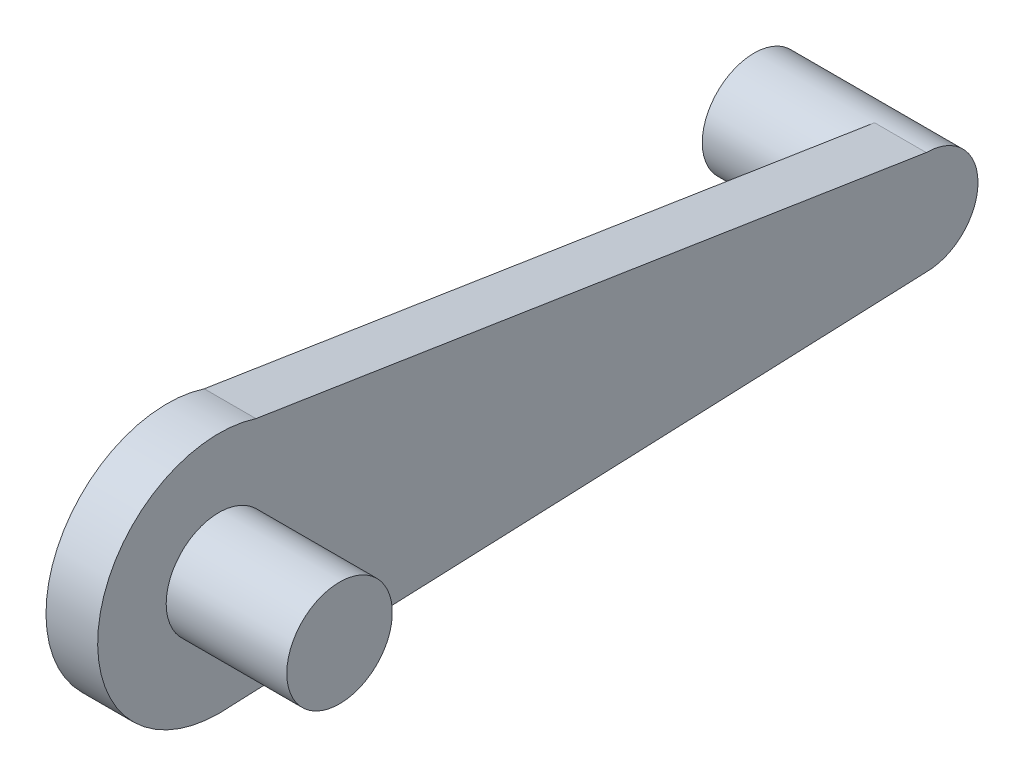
from build123d import *

# Parameters (mm, degrees)
SKETCH2_R           = 3.063635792
BOSS_EXTRUDE3_DEPTH = 7
SKETCH4_R           = 7.041546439
BOSS_EXTRUDE5_DEPTH = 3
SKETCH9_R           = 3.003465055
BOSS_EXTRUDE7_DEPTH = 3
BOSS_EXTRUDE8_DEPTH = 3
SKETCH11_R          = 3.003465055
BOSS_EXTRUDE9_DEPTH = 7
SCALE1_SCALE        = 3.8632269


with BuildPart() as part:
    # Sketch2 → Boss-Extrude3 (new body)
    with BuildSketch(Plane.ZY):
        with Locations((-10.440955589, 10.776713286)):
            Circle(SKETCH2_R)
    extrude(amount=BOSS_EXTRUDE3_DEPTH)

    # Sketch4 → Boss-Extrude5 (add)
    with BuildSketch(Plane.ZY.offset(7)):
        with Locations((-10.440955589, 10.776713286)):
            Circle(SKETCH4_R)
    extrude(amount=BOSS_EXTRUDE5_DEPTH)

    # Sketch10 → Boss-Extrude8 (add)
    with BuildSketch(Plane.ZY.offset(10)):
        Polygon((-10.440955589, 17.818259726), (-51.501250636, 11.402954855), (-51.501250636, 5.396024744), (-10.440955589, 3.735166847), align=None)
    extrude(amount=-BOSS_EXTRUDE8_DEPTH)



with BuildPart() as body_2:
    # Sketch9 → Boss-Extrude7 (new body)
    with BuildSketch(Plane.ZY.offset(7)):
        with Locations((-51.501250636, 8.3994898)):
            Circle(SKETCH9_R)
    extrude(amount=BOSS_EXTRUDE7_DEPTH)


with BuildPart() as part_1:
    add(part.part)

    add(body_2.part)  # Boss-Extrude9 merges body 2
    # Sketch11 → Boss-Extrude9 (add)
    with BuildSketch(Plane.ZY.offset(10)):
        with Locations(Location((-51.501250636, 8.3994898, 0), (0, 0, 90))):
            Circle(SKETCH11_R)
    extrude(amount=BOSS_EXTRUDE9_DEPTH)


with BuildPart() as part_2:
    # Scale1: scaled about (-8.479078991, 9.815735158, -26.726269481)
    add(part_1.part.scale(SCALE1_SCALE).moved(Location((24.277527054, -28.104676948, 76.523373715))))


solid = part_2.part
